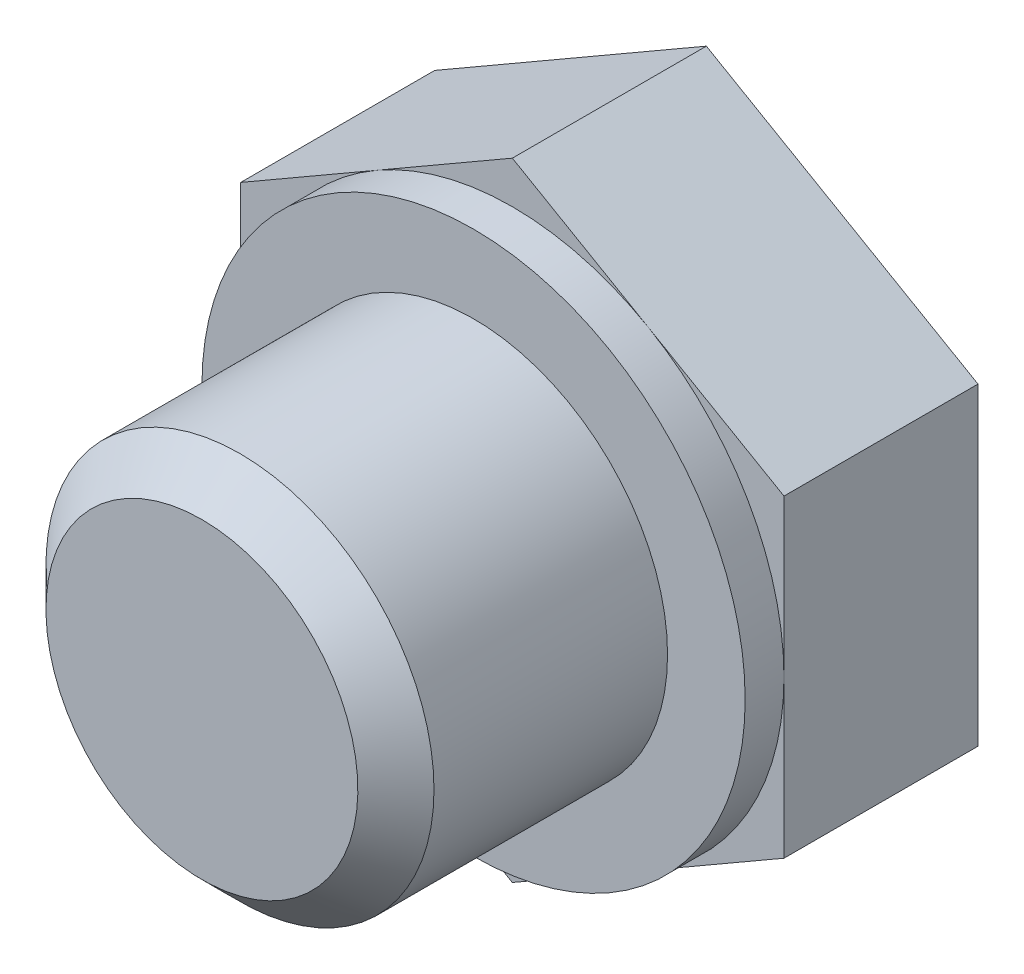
ISO-10303-21;
HEADER;
FILE_DESCRIPTION(('STEP AP214'),'2;1');
FILE_NAME('part.step','',(''),(''),'','','');
FILE_SCHEMA(('AUTOMOTIVE_DESIGN { 1 0 10303 214 1 1 1 1 }'));
ENDSEC;
DATA;
#1=APPLICATION_CONTEXT('core data for automotive mechanical design processes');
#2=APPLICATION_PROTOCOL_DEFINITION('international standard','automotive_design',2000,#1);
#3=PRODUCT_CONTEXT('',#1,'mechanical');
#4=PRODUCT('Part','Part','',(#3));
#5=PRODUCT_RELATED_PRODUCT_CATEGORY('part','',(#4));
#6=PRODUCT_DEFINITION_FORMATION('','',#4);
#7=PRODUCT_DEFINITION_CONTEXT('part definition',#1,'design');
#8=PRODUCT_DEFINITION('design','',#6,#7);
#9=PRODUCT_DEFINITION_SHAPE('','',#8);
#10=(LENGTH_UNIT() NAMED_UNIT(*) SI_UNIT(.MILLI.,.METRE.));
#11=(NAMED_UNIT(*) PLANE_ANGLE_UNIT() SI_UNIT($,.RADIAN.));
#12=(NAMED_UNIT(*) SI_UNIT($,.STERADIAN.) SOLID_ANGLE_UNIT());
#13=UNCERTAINTY_MEASURE_WITH_UNIT(LENGTH_MEASURE(1.E-05),#10,'distance_accuracy_value','');
#14=(GEOMETRIC_REPRESENTATION_CONTEXT(3) GLOBAL_UNCERTAINTY_ASSIGNED_CONTEXT((#13)) GLOBAL_UNIT_ASSIGNED_CONTEXT((#10,
#11,#12)) REPRESENTATION_CONTEXT('',''));
#15=CARTESIAN_POINT('',(0.,0.,0.));
#16=DIRECTION('',(0.,0.,1.));
#17=DIRECTION('',(1.,0.,0.));
#18=AXIS2_PLACEMENT_3D('',#15,#16,#17);
#19=CARTESIAN_POINT('',(0.,0.,3.5));
#20=DIRECTION('',(0.,0.,-1.));
#21=DIRECTION('',(-1.,0.,0.));
#22=AXIS2_PLACEMENT_3D('',#19,#20,#21);
#23=PLANE('',#22);
#24=CARTESIAN_POINT('',(0.,0.,3.49999999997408));
#25=DIRECTION('',(0.,0.,-1.));
#26=DIRECTION('',(0.,1.,0.));
#27=AXIS2_PLACEMENT_3D('',#24,#25,#26);
#28=CIRCLE('',#27,2.00949999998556);
#29=CARTESIAN_POINT('',(0.,2.00949999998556,3.49999999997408));
#30=VERTEX_POINT('',#29);
#31=EDGE_CURVE('E20',#30,#30,#28,.T.);
#32=ORIENTED_EDGE('',*,*,#31,.F.);
#33=EDGE_LOOP('',(#32));
#34=FACE_BOUND('',#33,.T.);
#35=ADVANCED_FACE('F17',(#34),#23,.F.);
#36=CARTESIAN_POINT('',(0.,0.,3.00950000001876));
#37=DIRECTION('',(0.,0.,-1.));
#38=DIRECTION('',(0.,1.,0.));
#39=AXIS2_PLACEMENT_3D('',#36,#37,#38);
#40=CONICAL_SURFACE('',#39,2.49999999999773,0.785398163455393);
#41=ORIENTED_EDGE('',*,*,#31,.T.);
#42=EDGE_LOOP('',(#41));
#43=FACE_BOUND('',#42,.T.);
#44=CARTESIAN_POINT('',(0.,0.,3.0095));
#45=DIRECTION('',(0.,0.,1.));
#46=DIRECTION('',(1.,0.,0.));
#47=AXIS2_PLACEMENT_3D('',#44,#45,#46);
#48=CIRCLE('',#47,2.5);
#49=CARTESIAN_POINT('',(2.5,0.,3.0095));
#50=VERTEX_POINT('',#49);
#51=EDGE_CURVE('E186',#50,#50,#48,.F.);
#52=ORIENTED_EDGE('',*,*,#51,.F.);
#53=EDGE_LOOP('',(#52));
#54=FACE_BOUND('',#53,.T.);
#55=ADVANCED_FACE('F205',(#43,#54),#40,.T.);
#56=CARTESIAN_POINT('',(0.,0.,0.));
#57=DIRECTION('',(0.,0.,1.));
#58=DIRECTION('',(1.,0.,0.));
#59=AXIS2_PLACEMENT_3D('',#56,#57,#58);
#60=CYLINDRICAL_SURFACE('',#59,2.5);
#61=CARTESIAN_POINT('',(0.,0.,0.));
#62=DIRECTION('',(0.,0.,1.));
#63=DIRECTION('',(1.,0.,0.));
#64=AXIS2_PLACEMENT_3D('',#61,#62,#63);
#65=CIRCLE('',#64,2.5);
#66=CARTESIAN_POINT('',(2.5,0.,0.));
#67=VERTEX_POINT('',#66);
#68=EDGE_CURVE('E189',#67,#67,#65,.F.);
#69=ORIENTED_EDGE('',*,*,#68,.F.);
#70=EDGE_LOOP('',(#69));
#71=FACE_BOUND('',#70,.T.);
#72=ORIENTED_EDGE('',*,*,#51,.T.);
#73=EDGE_LOOP('',(#72));
#74=FACE_BOUND('',#73,.T.);
#75=ADVANCED_FACE('F202',(#71,#74),#60,.T.);
#76=CARTESIAN_POINT('',(0.,0.,0.));
#77=DIRECTION('',(0.,0.,1.));
#78=DIRECTION('',(1.,0.,0.));
#79=AXIS2_PLACEMENT_3D('',#76,#77,#78);
#80=PLANE('',#79);
#81=ORIENTED_EDGE('',*,*,#68,.T.);
#82=EDGE_LOOP('',(#81));
#83=FACE_BOUND('',#82,.T.);
#84=CARTESIAN_POINT('',(0.,0.,0.));
#85=DIRECTION('',(0.,0.,1.));
#86=DIRECTION('',(1.,0.,0.));
#87=AXIS2_PLACEMENT_3D('',#84,#85,#86);
#88=CIRCLE('',#87,3.5);
#89=CARTESIAN_POINT('',(3.5,0.,0.));
#90=VERTEX_POINT('',#89);
#91=EDGE_CURVE('E100',#90,#90,#88,.F.);
#92=ORIENTED_EDGE('',*,*,#91,.F.);
#93=EDGE_LOOP('',(#92));
#94=FACE_BOUND('',#93,.T.);
#95=ADVANCED_FACE('F199',(#83,#94),#80,.T.);
#96=CARTESIAN_POINT('',(0.,0.,-0.5));
#97=DIRECTION('',(0.,0.,1.));
#98=DIRECTION('',(1.,0.,0.));
#99=AXIS2_PLACEMENT_3D('',#96,#97,#98);
#100=CYLINDRICAL_SURFACE('',#99,3.5);
#101=ORIENTED_EDGE('',*,*,#91,.T.);
#102=EDGE_LOOP('',(#101));
#103=FACE_BOUND('',#102,.T.);
#104=CARTESIAN_POINT('',(0.,0.,-0.5));
#105=DIRECTION('',(0.,0.,1.));
#106=DIRECTION('',(1.,0.,0.));
#107=AXIS2_PLACEMENT_3D('',#104,#105,#106);
#108=CIRCLE('',#107,3.5);
#109=CARTESIAN_POINT('',(1.75,3.03108891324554,-0.5));
#110=VERTEX_POINT('',#109);
#111=CARTESIAN_POINT('',(3.5,0.,-0.5));
#112=VERTEX_POINT('',#111);
#113=EDGE_CURVE('E120',#110,#112,#108,.F.);
#114=ORIENTED_EDGE('',*,*,#113,.F.);
#115=CARTESIAN_POINT('',(0.,0.,-0.5));
#116=DIRECTION('',(0.,0.,1.));
#117=DIRECTION('',(1.,0.,0.));
#118=AXIS2_PLACEMENT_3D('',#115,#116,#117);
#119=CIRCLE('',#118,3.5);
#120=CARTESIAN_POINT('',(-1.75,3.03108891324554,-0.5));
#121=VERTEX_POINT('',#120);
#122=EDGE_CURVE('E110',#121,#110,#119,.F.);
#123=ORIENTED_EDGE('',*,*,#122,.F.);
#124=CARTESIAN_POINT('',(0.,0.,-0.5));
#125=DIRECTION('',(0.,0.,1.));
#126=DIRECTION('',(1.,0.,0.));
#127=AXIS2_PLACEMENT_3D('',#124,#125,#126);
#128=CIRCLE('',#127,3.5);
#129=CARTESIAN_POINT('',(-3.5,0.,-0.5));
#130=VERTEX_POINT('',#129);
#131=EDGE_CURVE('E113',#130,#121,#128,.F.);
#132=ORIENTED_EDGE('',*,*,#131,.F.);
#133=CARTESIAN_POINT('',(0.,0.,-0.5));
#134=DIRECTION('',(0.,0.,1.));
#135=DIRECTION('',(1.,0.,0.));
#136=AXIS2_PLACEMENT_3D('',#133,#134,#135);
#137=CIRCLE('',#136,3.5);
#138=CARTESIAN_POINT('',(-1.75,-3.03108891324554,-0.5));
#139=VERTEX_POINT('',#138);
#140=EDGE_CURVE('E92',#139,#130,#137,.F.);
#141=ORIENTED_EDGE('',*,*,#140,.F.);
#142=CARTESIAN_POINT('',(0.,0.,-0.5));
#143=DIRECTION('',(0.,0.,1.));
#144=DIRECTION('',(1.,0.,0.));
#145=AXIS2_PLACEMENT_3D('',#142,#143,#144);
#146=CIRCLE('',#145,3.5);
#147=CARTESIAN_POINT('',(1.75,-3.03108891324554,-0.5));
#148=VERTEX_POINT('',#147);
#149=EDGE_CURVE('E85',#148,#139,#146,.F.);
#150=ORIENTED_EDGE('',*,*,#149,.F.);
#151=CARTESIAN_POINT('',(0.,0.,-0.5));
#152=DIRECTION('',(0.,0.,1.));
#153=DIRECTION('',(1.,0.,0.));
#154=AXIS2_PLACEMENT_3D('',#151,#152,#153);
#155=CIRCLE('',#154,3.5);
#156=EDGE_CURVE('E192',#112,#148,#155,.F.);
#157=ORIENTED_EDGE('',*,*,#156,.F.);
#158=EDGE_LOOP('',(#114,#123,#132,#141,#150,#157));
#159=FACE_BOUND('',#158,.T.);
#160=ADVANCED_FACE('F115',(#103,#159),#100,.T.);
#161=CARTESIAN_POINT('',(0.,0.,-0.5));
#162=DIRECTION('',(0.,0.,1.));
#163=DIRECTION('',(1.,0.,0.));
#164=AXIS2_PLACEMENT_3D('',#161,#162,#163);
#165=PLANE('',#164);
#166=DIRECTION('',(0.,1.,0.));
#167=VECTOR('',#166,1.);
#168=CARTESIAN_POINT('',(-3.5,2.02072594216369,-0.5));
#169=LINE('',#168,#167);
#170=CARTESIAN_POINT('',(-3.5,-2.02072594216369,-0.5));
#171=VERTEX_POINT('',#170);
#172=EDGE_CURVE('E95',#171,#130,#169,.T.);
#173=ORIENTED_EDGE('',*,*,#172,.F.);
#174=DIRECTION('',(0.866025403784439,-0.5,0.));
#175=VECTOR('',#174,1.);
#176=CARTESIAN_POINT('',(-3.5,-2.02072594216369,-0.5));
#177=LINE('',#176,#175);
#178=EDGE_CURVE('E97',#139,#171,#177,.F.);
#179=ORIENTED_EDGE('',*,*,#178,.F.);
#180=ORIENTED_EDGE('',*,*,#140,.T.);
#181=EDGE_LOOP('',(#173,#179,#180));
#182=FACE_BOUND('',#181,.T.);
#183=ADVANCED_FACE('F94',(#182),#165,.T.);
#184=CARTESIAN_POINT('',(0.,0.,-0.5));
#185=DIRECTION('',(0.,0.,1.));
#186=DIRECTION('',(1.,0.,0.));
#187=AXIS2_PLACEMENT_3D('',#184,#185,#186);
#188=PLANE('',#187);
#189=DIRECTION('',(0.866025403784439,-0.5,0.));
#190=VECTOR('',#189,1.);
#191=CARTESIAN_POINT('',(-3.5,-2.02072594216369,-0.5));
#192=LINE('',#191,#190);
#193=CARTESIAN_POINT('',(0.,-4.04145188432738,-0.5));
#194=VERTEX_POINT('',#193);
#195=EDGE_CURVE('E124',#194,#139,#192,.F.);
#196=ORIENTED_EDGE('',*,*,#195,.F.);
#197=DIRECTION('',(0.866025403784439,0.5,0.));
#198=VECTOR('',#197,1.);
#199=CARTESIAN_POINT('',(0.,-4.04145188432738,-0.5));
#200=LINE('',#199,#198);
#201=EDGE_CURVE('E164',#148,#194,#200,.F.);
#202=ORIENTED_EDGE('',*,*,#201,.F.);
#203=ORIENTED_EDGE('',*,*,#149,.T.);
#204=EDGE_LOOP('',(#196,#202,#203));
#205=FACE_BOUND('',#204,.T.);
#206=ADVANCED_FACE('F259',(#205),#188,.T.);
#207=CARTESIAN_POINT('',(0.,0.,-0.5));
#208=DIRECTION('',(0.,0.,1.));
#209=DIRECTION('',(1.,0.,0.));
#210=AXIS2_PLACEMENT_3D('',#207,#208,#209);
#211=PLANE('',#210);
#212=DIRECTION('',(0.866025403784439,0.5,0.));
#213=VECTOR('',#212,1.);
#214=CARTESIAN_POINT('',(0.,-4.04145188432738,-0.5));
#215=LINE('',#214,#213);
#216=CARTESIAN_POINT('',(3.5,-2.02072594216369,-0.5));
#217=VERTEX_POINT('',#216);
#218=EDGE_CURVE('E161',#217,#148,#215,.F.);
#219=ORIENTED_EDGE('',*,*,#218,.F.);
#220=DIRECTION('',(0.,1.,0.));
#221=VECTOR('',#220,1.);
#222=CARTESIAN_POINT('',(3.5,-2.02072594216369,-0.5));
#223=LINE('',#222,#221);
#224=EDGE_CURVE('E149',#112,#217,#223,.F.);
#225=ORIENTED_EDGE('',*,*,#224,.F.);
#226=ORIENTED_EDGE('',*,*,#156,.T.);
#227=EDGE_LOOP('',(#219,#225,#226));
#228=FACE_BOUND('',#227,.T.);
#229=ADVANCED_FACE('F255',(#228),#211,.T.);
#230=CARTESIAN_POINT('',(0.,0.,-0.5));
#231=DIRECTION('',(0.,0.,1.));
#232=DIRECTION('',(1.,0.,0.));
#233=AXIS2_PLACEMENT_3D('',#230,#231,#232);
#234=PLANE('',#233);
#235=DIRECTION('',(0.,1.,0.));
#236=VECTOR('',#235,1.);
#237=CARTESIAN_POINT('',(3.5,-2.02072594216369,-0.5));
#238=LINE('',#237,#236);
#239=CARTESIAN_POINT('',(3.5,2.02072594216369,-0.5));
#240=VERTEX_POINT('',#239);
#241=EDGE_CURVE('E146',#240,#112,#238,.F.);
#242=ORIENTED_EDGE('',*,*,#241,.F.);
#243=DIRECTION('',(-0.866025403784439,0.5,0.));
#244=VECTOR('',#243,1.);
#245=CARTESIAN_POINT('',(3.5,2.02072594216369,-0.5));
#246=LINE('',#245,#244);
#247=EDGE_CURVE('E140',#110,#240,#246,.F.);
#248=ORIENTED_EDGE('',*,*,#247,.F.);
#249=ORIENTED_EDGE('',*,*,#113,.T.);
#250=EDGE_LOOP('',(#242,#248,#249));
#251=FACE_BOUND('',#250,.T.);
#252=ADVANCED_FACE('F252',(#251),#234,.T.);
#253=CARTESIAN_POINT('',(0.,0.,-0.5));
#254=DIRECTION('',(0.,0.,1.));
#255=DIRECTION('',(1.,0.,0.));
#256=AXIS2_PLACEMENT_3D('',#253,#254,#255);
#257=PLANE('',#256);
#258=ORIENTED_EDGE('',*,*,#131,.T.);
#259=DIRECTION('',(-0.866025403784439,-0.5,0.));
#260=VECTOR('',#259,1.);
#261=CARTESIAN_POINT('',(0.,4.04145188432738,-0.5));
#262=LINE('',#261,#260);
#263=CARTESIAN_POINT('',(-3.5,2.02072594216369,-0.5));
#264=VERTEX_POINT('',#263);
#265=EDGE_CURVE('E123',#264,#121,#262,.F.);
#266=ORIENTED_EDGE('',*,*,#265,.F.);
#267=DIRECTION('',(0.,1.,0.));
#268=VECTOR('',#267,1.);
#269=CARTESIAN_POINT('',(-3.5,2.02072594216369,-0.5));
#270=LINE('',#269,#268);
#271=EDGE_CURVE('E106',#130,#264,#270,.T.);
#272=ORIENTED_EDGE('',*,*,#271,.F.);
#273=EDGE_LOOP('',(#258,#266,#272));
#274=FACE_BOUND('',#273,.T.);
#275=ADVANCED_FACE('F122',(#274),#257,.T.);
#276=CARTESIAN_POINT('',(0.,0.,-0.5));
#277=DIRECTION('',(0.,0.,1.));
#278=DIRECTION('',(1.,0.,0.));
#279=AXIS2_PLACEMENT_3D('',#276,#277,#278);
#280=PLANE('',#279);
#281=DIRECTION('',(-0.866025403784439,0.5,0.));
#282=VECTOR('',#281,1.);
#283=CARTESIAN_POINT('',(3.5,2.02072594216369,-0.5));
#284=LINE('',#283,#282);
#285=CARTESIAN_POINT('',(0.,4.04145188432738,-0.5));
#286=VERTEX_POINT('',#285);
#287=EDGE_CURVE('E143',#286,#110,#284,.F.);
#288=ORIENTED_EDGE('',*,*,#287,.F.);
#289=DIRECTION('',(-0.866025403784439,-0.5,0.));
#290=VECTOR('',#289,1.);
#291=CARTESIAN_POINT('',(0.,4.04145188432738,-0.5));
#292=LINE('',#291,#290);
#293=EDGE_CURVE('E426',#121,#286,#292,.F.);
#294=ORIENTED_EDGE('',*,*,#293,.F.);
#295=ORIENTED_EDGE('',*,*,#122,.T.);
#296=EDGE_LOOP('',(#288,#294,#295));
#297=FACE_BOUND('',#296,.T.);
#298=ADVANCED_FACE('F246',(#297),#280,.T.);
#299=CARTESIAN_POINT('',(-3.5,2.02072594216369,-3.));
#300=DIRECTION('',(-1.,0.,0.));
#301=DIRECTION('',(0.,0.,1.));
#302=AXIS2_PLACEMENT_3D('',#299,#300,#301);
#303=PLANE('',#302);
#304=DIRECTION('',(0.,0.,1.));
#305=VECTOR('',#304,1.);
#306=CARTESIAN_POINT('',(-3.5,2.02072594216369,-3.));
#307=LINE('',#306,#305);
#308=CARTESIAN_POINT('',(-3.5,2.02072594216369,-3.));
#309=VERTEX_POINT('',#308);
#310=EDGE_CURVE('E154',#309,#264,#307,.T.);
#311=ORIENTED_EDGE('',*,*,#310,.F.);
#312=DIRECTION('',(0.,1.,0.));
#313=VECTOR('',#312,1.);
#314=CARTESIAN_POINT('',(-3.5,0.,-3.));
#315=LINE('',#314,#313);
#316=CARTESIAN_POINT('',(-3.5,-2.02072594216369,-3.));
#317=VERTEX_POINT('',#316);
#318=EDGE_CURVE('E133',#309,#317,#315,.F.);
#319=ORIENTED_EDGE('',*,*,#318,.T.);
#320=DIRECTION('',(0.,0.,1.));
#321=VECTOR('',#320,1.);
#322=CARTESIAN_POINT('',(-3.5,-2.02072594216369,-3.));
#323=LINE('',#322,#321);
#324=EDGE_CURVE('E109',#171,#317,#323,.F.);
#325=ORIENTED_EDGE('',*,*,#324,.F.);
#326=ORIENTED_EDGE('',*,*,#172,.T.);
#327=ORIENTED_EDGE('',*,*,#271,.T.);
#328=EDGE_LOOP('',(#311,#319,#325,#326,#327));
#329=FACE_BOUND('',#328,.T.);
#330=ADVANCED_FACE('F104',(#329),#303,.T.);
#331=CARTESIAN_POINT('',(-3.5,-2.02072594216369,-3.));
#332=DIRECTION('',(-0.5,-0.866025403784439,0.));
#333=DIRECTION('',(0.866025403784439,-0.5,0.));
#334=AXIS2_PLACEMENT_3D('',#331,#332,#333);
#335=PLANE('',#334);
#336=ORIENTED_EDGE('',*,*,#324,.T.);
#337=DIRECTION('',(0.866025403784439,-0.5,0.));
#338=VECTOR('',#337,1.);
#339=CARTESIAN_POINT('',(-3.5,-2.02072594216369,-3.));
#340=LINE('',#339,#338);
#341=CARTESIAN_POINT('',(0.,-4.04145188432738,-3.));
#342=VERTEX_POINT('',#341);
#343=EDGE_CURVE('E135',#317,#342,#340,.T.);
#344=ORIENTED_EDGE('',*,*,#343,.T.);
#345=DIRECTION('',(0.,0.,1.));
#346=VECTOR('',#345,1.);
#347=CARTESIAN_POINT('',(0.,-4.04145188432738,-3.));
#348=LINE('',#347,#346);
#349=EDGE_CURVE('E150',#194,#342,#348,.F.);
#350=ORIENTED_EDGE('',*,*,#349,.F.);
#351=ORIENTED_EDGE('',*,*,#195,.T.);
#352=ORIENTED_EDGE('',*,*,#178,.T.);
#353=EDGE_LOOP('',(#336,#344,#350,#351,#352));
#354=FACE_BOUND('',#353,.T.);
#355=ADVANCED_FACE('F239',(#354),#335,.T.);
#356=CARTESIAN_POINT('',(0.,-4.04145188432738,-3.));
#357=DIRECTION('',(0.5,-0.866025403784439,0.));
#358=DIRECTION('',(0.866025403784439,0.5,0.));
#359=AXIS2_PLACEMENT_3D('',#356,#357,#358);
#360=PLANE('',#359);
#361=ORIENTED_EDGE('',*,*,#349,.T.);
#362=DIRECTION('',(0.866025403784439,0.5,0.));
#363=VECTOR('',#362,1.);
#364=CARTESIAN_POINT('',(0.,-4.04145188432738,-3.));
#365=LINE('',#364,#363);
#366=CARTESIAN_POINT('',(3.5,-2.02072594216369,-3.));
#367=VERTEX_POINT('',#366);
#368=EDGE_CURVE('E416',#342,#367,#365,.T.);
#369=ORIENTED_EDGE('',*,*,#368,.T.);
#370=DIRECTION('',(0.,0.,-1.));
#371=VECTOR('',#370,1.);
#372=CARTESIAN_POINT('',(3.5,-2.02072594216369,-3.));
#373=LINE('',#372,#371);
#374=EDGE_CURVE('E158',#217,#367,#373,.T.);
#375=ORIENTED_EDGE('',*,*,#374,.F.);
#376=ORIENTED_EDGE('',*,*,#218,.T.);
#377=ORIENTED_EDGE('',*,*,#201,.T.);
#378=EDGE_LOOP('',(#361,#369,#375,#376,#377));
#379=FACE_BOUND('',#378,.T.);
#380=ADVANCED_FACE('F235',(#379),#360,.T.);
#381=CARTESIAN_POINT('',(3.5,-2.02072594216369,-3.));
#382=DIRECTION('',(1.,0.,0.));
#383=DIRECTION('',(0.,0.,-1.));
#384=AXIS2_PLACEMENT_3D('',#381,#382,#383);
#385=PLANE('',#384);
#386=ORIENTED_EDGE('',*,*,#374,.T.);
#387=DIRECTION('',(0.,1.,0.));
#388=VECTOR('',#387,1.);
#389=CARTESIAN_POINT('',(3.5,0.,-3.));
#390=LINE('',#389,#388);
#391=CARTESIAN_POINT('',(3.5,2.02072594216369,-3.));
#392=VERTEX_POINT('',#391);
#393=EDGE_CURVE('E419',#367,#392,#390,.T.);
#394=ORIENTED_EDGE('',*,*,#393,.T.);
#395=DIRECTION('',(0.,0.,1.));
#396=VECTOR('',#395,1.);
#397=CARTESIAN_POINT('',(3.5,2.02072594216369,-3.));
#398=LINE('',#397,#396);
#399=EDGE_CURVE('E142',#240,#392,#398,.F.);
#400=ORIENTED_EDGE('',*,*,#399,.F.);
#401=ORIENTED_EDGE('',*,*,#241,.T.);
#402=ORIENTED_EDGE('',*,*,#224,.T.);
#403=EDGE_LOOP('',(#386,#394,#400,#401,#402));
#404=FACE_BOUND('',#403,.T.);
#405=ADVANCED_FACE('F231',(#404),#385,.T.);
#406=CARTESIAN_POINT('',(3.5,2.02072594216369,-3.));
#407=DIRECTION('',(0.5,0.866025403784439,0.));
#408=DIRECTION('',(-0.866025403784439,0.5,0.));
#409=AXIS2_PLACEMENT_3D('',#406,#407,#408);
#410=PLANE('',#409);
#411=ORIENTED_EDGE('',*,*,#399,.T.);
#412=DIRECTION('',(-0.866025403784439,0.5,0.));
#413=VECTOR('',#412,1.);
#414=CARTESIAN_POINT('',(3.5,2.02072594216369,-3.));
#415=LINE('',#414,#413);
#416=CARTESIAN_POINT('',(0.,4.04145188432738,-3.));
#417=VERTEX_POINT('',#416);
#418=EDGE_CURVE('E26',#392,#417,#415,.T.);
#419=ORIENTED_EDGE('',*,*,#418,.T.);
#420=DIRECTION('',(0.,0.,1.));
#421=VECTOR('',#420,1.);
#422=CARTESIAN_POINT('',(0.,4.04145188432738,-3.));
#423=LINE('',#422,#421);
#424=EDGE_CURVE('E34',#286,#417,#423,.F.);
#425=ORIENTED_EDGE('',*,*,#424,.F.);
#426=ORIENTED_EDGE('',*,*,#287,.T.);
#427=ORIENTED_EDGE('',*,*,#247,.T.);
#428=EDGE_LOOP('',(#411,#419,#425,#426,#427));
#429=FACE_BOUND('',#428,.T.);
#430=ADVANCED_FACE('F225',(#429),#410,.T.);
#431=CARTESIAN_POINT('',(0.,4.04145188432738,-3.));
#432=DIRECTION('',(-0.5,0.866025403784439,0.));
#433=DIRECTION('',(-0.866025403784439,-0.5,0.));
#434=AXIS2_PLACEMENT_3D('',#431,#432,#433);
#435=PLANE('',#434);
#436=ORIENTED_EDGE('',*,*,#424,.T.);
#437=DIRECTION('',(-0.866025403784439,-0.5,0.));
#438=VECTOR('',#437,1.);
#439=CARTESIAN_POINT('',(0.,4.04145188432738,-3.));
#440=LINE('',#439,#438);
#441=EDGE_CURVE('E11',#417,#309,#440,.T.);
#442=ORIENTED_EDGE('',*,*,#441,.T.);
#443=ORIENTED_EDGE('',*,*,#310,.T.);
#444=ORIENTED_EDGE('',*,*,#265,.T.);
#445=ORIENTED_EDGE('',*,*,#293,.T.);
#446=EDGE_LOOP('',(#436,#442,#443,#444,#445));
#447=FACE_BOUND('',#446,.T.);
#448=ADVANCED_FACE('F219',(#447),#435,.T.);
#449=CARTESIAN_POINT('',(0.,0.,-3.));
#450=DIRECTION('',(0.,0.,1.));
#451=DIRECTION('',(1.,0.,0.));
#452=AXIS2_PLACEMENT_3D('',#449,#450,#451);
#453=PLANE('',#452);
#454=ORIENTED_EDGE('',*,*,#418,.F.);
#455=ORIENTED_EDGE('',*,*,#393,.F.);
#456=ORIENTED_EDGE('',*,*,#368,.F.);
#457=ORIENTED_EDGE('',*,*,#343,.F.);
#458=ORIENTED_EDGE('',*,*,#318,.F.);
#459=ORIENTED_EDGE('',*,*,#441,.F.);
#460=EDGE_LOOP('',(#454,#455,#456,#457,#458,#459));
#461=FACE_BOUND('',#460,.T.);
#462=ADVANCED_FACE('F217',(#461),#453,.F.);
#463=CLOSED_SHELL('',(#35,#55,#75,#95,#160,#183,#206,#229,#252,#275,#298,#330,#355,#380,#405,
#430,#448,#462));
#464=MANIFOLD_SOLID_BREP('B1',#463);
#465=ADVANCED_BREP_SHAPE_REPRESENTATION('',(#18,#464),#14);
#466=SHAPE_DEFINITION_REPRESENTATION(#9,#465);
ENDSEC;
END-ISO-10303-21;
